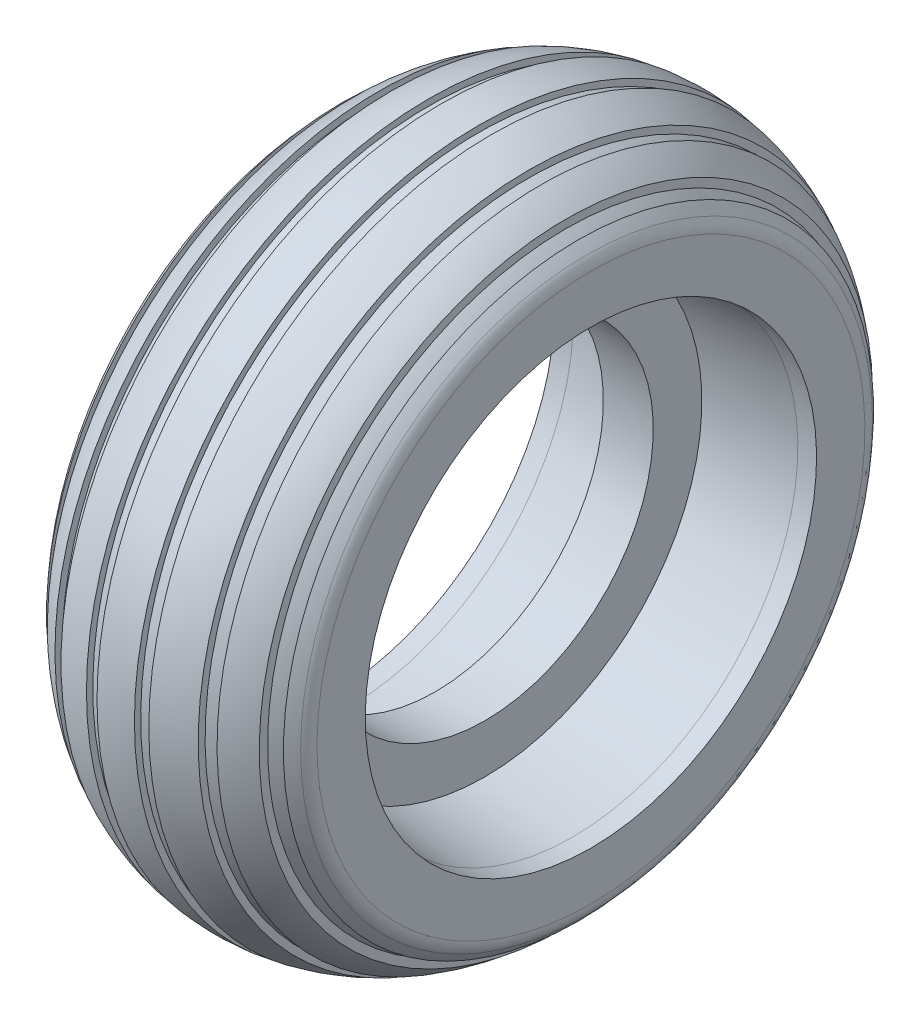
ISO-10303-21;
HEADER;
FILE_DESCRIPTION(('STEP AP214'),'2;1');
FILE_NAME('part.step','',(''),(''),'','','');
FILE_SCHEMA(('AUTOMOTIVE_DESIGN { 1 0 10303 214 1 1 1 1 }'));
ENDSEC;
DATA;
#1=APPLICATION_CONTEXT('core data for automotive mechanical design processes');
#2=APPLICATION_PROTOCOL_DEFINITION('international standard','automotive_design',2000,#1);
#3=PRODUCT_CONTEXT('',#1,'mechanical');
#4=PRODUCT('Part','Part','',(#3));
#5=PRODUCT_RELATED_PRODUCT_CATEGORY('part','',(#4));
#6=PRODUCT_DEFINITION_FORMATION('','',#4);
#7=PRODUCT_DEFINITION_CONTEXT('part definition',#1,'design');
#8=PRODUCT_DEFINITION('design','',#6,#7);
#9=PRODUCT_DEFINITION_SHAPE('','',#8);
#10=(LENGTH_UNIT() NAMED_UNIT(*) SI_UNIT(.MILLI.,.METRE.));
#11=(NAMED_UNIT(*) PLANE_ANGLE_UNIT() SI_UNIT($,.RADIAN.));
#12=(NAMED_UNIT(*) SI_UNIT($,.STERADIAN.) SOLID_ANGLE_UNIT());
#13=UNCERTAINTY_MEASURE_WITH_UNIT(LENGTH_MEASURE(1.E-05),#10,'distance_accuracy_value','');
#14=(GEOMETRIC_REPRESENTATION_CONTEXT(3) GLOBAL_UNCERTAINTY_ASSIGNED_CONTEXT((#13)) GLOBAL_UNIT_ASSIGNED_CONTEXT((#10,
#11,#12)) REPRESENTATION_CONTEXT('',''));
#15=CARTESIAN_POINT('',(0.,0.,0.));
#16=DIRECTION('',(0.,0.,1.));
#17=DIRECTION('',(1.,0.,0.));
#18=AXIS2_PLACEMENT_3D('',#15,#16,#17);
#19=CARTESIAN_POINT('',(-61.4889458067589,0.,0.));
#20=DIRECTION('',(-1.,0.,0.));
#21=DIRECTION('',(0.,-1.,0.));
#22=AXIS2_PLACEMENT_3D('',#19,#20,#21);
#23=CYLINDRICAL_SURFACE('',#22,18.1);
#24=CARTESIAN_POINT('',(-9.,0.,0.));
#25=DIRECTION('',(-1.,0.,0.));
#26=DIRECTION('',(0.,-1.,0.));
#27=AXIS2_PLACEMENT_3D('',#24,#25,#26);
#28=CIRCLE('',#27,18.1);
#29=CARTESIAN_POINT('',(-9.,-18.1,0.));
#30=VERTEX_POINT('',#29);
#31=EDGE_CURVE('E144',#30,#30,#28,.T.);
#32=ORIENTED_EDGE('',*,*,#31,.F.);
#33=EDGE_LOOP('',(#32));
#34=FACE_BOUND('',#33,.T.);
#35=CARTESIAN_POINT('',(-10.5,0.,0.));
#36=DIRECTION('',(-1.,0.,0.));
#37=DIRECTION('',(0.,-1.,0.));
#38=AXIS2_PLACEMENT_3D('',#35,#36,#37);
#39=CIRCLE('',#38,18.1);
#40=CARTESIAN_POINT('',(-10.5,-18.1,0.));
#41=VERTEX_POINT('',#40);
#42=EDGE_CURVE('E10',#41,#41,#39,.T.);
#43=ORIENTED_EDGE('',*,*,#42,.T.);
#44=EDGE_LOOP('',(#43));
#45=FACE_BOUND('',#44,.T.);
#46=ADVANCED_FACE('F32',(#34,#45),#23,.F.);
#47=CARTESIAN_POINT('',(-10.5,18.1,0.));
#48=DIRECTION('',(1.,0.,0.));
#49=DIRECTION('',(0.,1.,0.));
#50=AXIS2_PLACEMENT_3D('',#47,#48,#49);
#51=PLANE('',#50);
#52=ORIENTED_EDGE('',*,*,#42,.F.);
#53=EDGE_LOOP('',(#52));
#54=FACE_BOUND('',#53,.T.);
#55=CARTESIAN_POINT('',(-10.5,0.,0.));
#56=DIRECTION('',(-1.,0.,0.));
#57=DIRECTION('',(0.,-1.,0.));
#58=AXIS2_PLACEMENT_3D('',#55,#56,#57);
#59=CIRCLE('',#58,21.97650467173);
#60=CARTESIAN_POINT('',(-10.5,-21.97650467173,0.));
#61=VERTEX_POINT('',#60);
#62=EDGE_CURVE('E38',#61,#61,#59,.T.);
#63=ORIENTED_EDGE('',*,*,#62,.T.);
#64=EDGE_LOOP('',(#63));
#65=FACE_BOUND('',#64,.T.);
#66=ADVANCED_FACE('F151',(#54,#65),#51,.F.);
#67=CARTESIAN_POINT('',(-9.,0.,0.));
#68=DIRECTION('',(-1.,0.,0.));
#69=DIRECTION('',(0.,-1.,0.));
#70=AXIS2_PLACEMENT_3D('',#67,#68,#69);
#71=TOROIDAL_SURFACE('',#70,21.97650467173,1.5);
#72=ORIENTED_EDGE('',*,*,#62,.F.);
#73=EDGE_LOOP('',(#72));
#74=FACE_BOUND('',#73,.T.);
#75=CARTESIAN_POINT('',(-10.1537513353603,0.,0.));
#76=DIRECTION('',(-1.,0.,0.));
#77=DIRECTION('',(0.,-1.,0.));
#78=AXIS2_PLACEMENT_3D('',#75,#76,#77);
#79=CIRCLE('',#78,22.9350754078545);
#80=CARTESIAN_POINT('',(-10.1537513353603,-22.9350754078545,0.));
#81=VERTEX_POINT('',#80);
#82=EDGE_CURVE('E42',#81,#81,#79,.T.);
#83=ORIENTED_EDGE('',*,*,#82,.T.);
#84=EDGE_LOOP('',(#83));
#85=FACE_BOUND('',#84,.T.);
#86=ADVANCED_FACE('F155',(#74,#85),#71,.T.);
#87=CARTESIAN_POINT('',(0.,0.,0.));
#88=DIRECTION('',(-1.,0.,0.));
#89=DIRECTION('',(0.,-1.,0.));
#90=AXIS2_PLACEMENT_3D('',#87,#88,#89);
#91=TOROIDAL_SURFACE('',#90,14.4990384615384,13.2009615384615);
#92=ORIENTED_EDGE('',*,*,#82,.F.);
#93=EDGE_LOOP('',(#92));
#94=FACE_BOUND('',#93,.T.);
#95=CARTESIAN_POINT('',(-9.49999999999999,0.,0.));
#96=DIRECTION('',(-1.,0.,0.));
#97=DIRECTION('',(0.,-1.,0.));
#98=AXIS2_PLACEMENT_3D('',#95,#96,#97);
#99=CIRCLE('',#98,23.6650291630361);
#100=CARTESIAN_POINT('',(-9.49999999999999,-23.6650291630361,0.));
#101=VERTEX_POINT('',#100);
#102=EDGE_CURVE('E46',#101,#101,#99,.T.);
#103=ORIENTED_EDGE('',*,*,#102,.T.);
#104=EDGE_LOOP('',(#103));
#105=FACE_BOUND('',#104,.T.);
#106=ADVANCED_FACE('F160',(#94,#105),#91,.T.);
#107=CARTESIAN_POINT('',(-9.5,23.6650291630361,0.));
#108=DIRECTION('',(-1.,0.,0.));
#109=DIRECTION('',(0.,-1.,0.));
#110=AXIS2_PLACEMENT_3D('',#107,#108,#109);
#111=PLANE('',#110);
#112=ORIENTED_EDGE('',*,*,#102,.F.);
#113=EDGE_LOOP('',(#112));
#114=FACE_BOUND('',#113,.T.);
#115=CARTESIAN_POINT('',(-9.49999999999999,0.,0.));
#116=DIRECTION('',(-1.,0.,0.));
#117=DIRECTION('',(0.,-1.,0.));
#118=AXIS2_PLACEMENT_3D('',#115,#116,#117);
#119=CIRCLE('',#118,22.929010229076);
#120=CARTESIAN_POINT('',(-9.49999999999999,-22.9290102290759,0.));
#121=VERTEX_POINT('',#120);
#122=EDGE_CURVE('E51',#121,#121,#119,.T.);
#123=ORIENTED_EDGE('',*,*,#122,.T.);
#124=EDGE_LOOP('',(#123));
#125=FACE_BOUND('',#124,.T.);
#126=ADVANCED_FACE('F166',(#114,#125),#111,.F.);
#127=CARTESIAN_POINT('',(0.,0.,0.));
#128=DIRECTION('',(-1.,0.,0.));
#129=DIRECTION('',(0.,-1.,0.));
#130=AXIS2_PLACEMENT_3D('',#127,#128,#129);
#131=TOROIDAL_SURFACE('',#130,14.4990384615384,12.7009615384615);
#132=ORIENTED_EDGE('',*,*,#122,.F.);
#133=EDGE_LOOP('',(#132));
#134=FACE_BOUND('',#133,.T.);
#135=CARTESIAN_POINT('',(-8.49999999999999,0.,0.));
#136=DIRECTION('',(-1.,0.,0.));
#137=DIRECTION('',(0.,-1.,0.));
#138=AXIS2_PLACEMENT_3D('',#135,#136,#137);
#139=CIRCLE('',#138,23.9364334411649);
#140=CARTESIAN_POINT('',(-8.49999999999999,-23.9364334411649,0.));
#141=VERTEX_POINT('',#140);
#142=EDGE_CURVE('E54',#141,#141,#139,.T.);
#143=ORIENTED_EDGE('',*,*,#142,.T.);
#144=EDGE_LOOP('',(#143));
#145=FACE_BOUND('',#144,.T.);
#146=ADVANCED_FACE('F170',(#134,#145),#131,.T.);
#147=CARTESIAN_POINT('',(-8.5,24.5993050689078,0.));
#148=DIRECTION('',(1.,0.,0.));
#149=DIRECTION('',(0.,1.,0.));
#150=AXIS2_PLACEMENT_3D('',#147,#148,#149);
#151=PLANE('',#150);
#152=ORIENTED_EDGE('',*,*,#142,.F.);
#153=EDGE_LOOP('',(#152));
#154=FACE_BOUND('',#153,.T.);
#155=CARTESIAN_POINT('',(-8.49999999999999,0.,0.));
#156=DIRECTION('',(-1.,0.,0.));
#157=DIRECTION('',(0.,-1.,0.));
#158=AXIS2_PLACEMENT_3D('',#155,#156,#157);
#159=CIRCLE('',#158,24.5993050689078);
#160=CARTESIAN_POINT('',(-8.49999999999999,-24.5993050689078,0.));
#161=VERTEX_POINT('',#160);
#162=EDGE_CURVE('E57',#161,#161,#159,.T.);
#163=ORIENTED_EDGE('',*,*,#162,.T.);
#164=EDGE_LOOP('',(#163));
#165=FACE_BOUND('',#164,.T.);
#166=ADVANCED_FACE('F174',(#154,#165),#151,.F.);
#167=CARTESIAN_POINT('',(0.,0.,0.));
#168=DIRECTION('',(-1.,0.,0.));
#169=DIRECTION('',(0.,-1.,0.));
#170=AXIS2_PLACEMENT_3D('',#167,#168,#169);
#171=TOROIDAL_SURFACE('',#170,14.4990384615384,13.2009615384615);
#172=ORIENTED_EDGE('',*,*,#162,.F.);
#173=EDGE_LOOP('',(#172));
#174=FACE_BOUND('',#173,.T.);
#175=CARTESIAN_POINT('',(-6.5,0.,0.));
#176=DIRECTION('',(-1.,0.,0.));
#177=DIRECTION('',(0.,-1.,0.));
#178=AXIS2_PLACEMENT_3D('',#175,#176,#177);
#179=CIRCLE('',#178,25.988833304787);
#180=CARTESIAN_POINT('',(-6.49999999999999,-25.988833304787,0.));
#181=VERTEX_POINT('',#180);
#182=EDGE_CURVE('E60',#181,#181,#179,.T.);
#183=ORIENTED_EDGE('',*,*,#182,.T.);
#184=EDGE_LOOP('',(#183));
#185=FACE_BOUND('',#184,.T.);
#186=ADVANCED_FACE('F178',(#174,#185),#171,.T.);
#187=CARTESIAN_POINT('',(-6.5,25.988833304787,0.));
#188=DIRECTION('',(-1.,0.,0.));
#189=DIRECTION('',(0.,-1.,0.));
#190=AXIS2_PLACEMENT_3D('',#187,#188,#189);
#191=PLANE('',#190);
#192=ORIENTED_EDGE('',*,*,#182,.F.);
#193=EDGE_LOOP('',(#192));
#194=FACE_BOUND('',#193,.T.);
#195=CARTESIAN_POINT('',(-6.49999999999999,0.,0.));
#196=DIRECTION('',(-1.,0.,0.));
#197=DIRECTION('',(0.,-1.,0.));
#198=AXIS2_PLACEMENT_3D('',#195,#196,#197);
#199=CIRCLE('',#198,25.410703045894);
#200=CARTESIAN_POINT('',(-6.49999999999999,-25.410703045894,0.));
#201=VERTEX_POINT('',#200);
#202=EDGE_CURVE('E63',#201,#201,#199,.T.);
#203=ORIENTED_EDGE('',*,*,#202,.T.);
#204=EDGE_LOOP('',(#203));
#205=FACE_BOUND('',#204,.T.);
#206=ADVANCED_FACE('F182',(#194,#205),#191,.F.);
#207=CARTESIAN_POINT('',(0.,0.,0.));
#208=DIRECTION('',(-1.,0.,0.));
#209=DIRECTION('',(0.,-1.,0.));
#210=AXIS2_PLACEMENT_3D('',#207,#208,#209);
#211=TOROIDAL_SURFACE('',#210,14.4990384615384,12.7009615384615);
#212=ORIENTED_EDGE('',*,*,#202,.F.);
#213=EDGE_LOOP('',(#212));
#214=FACE_BOUND('',#213,.T.);
#215=CARTESIAN_POINT('',(-5.49999999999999,0.,0.));
#216=DIRECTION('',(-1.,0.,0.));
#217=DIRECTION('',(0.,-1.,0.));
#218=AXIS2_PLACEMENT_3D('',#215,#216,#217);
#219=CIRCLE('',#218,25.9473756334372);
#220=CARTESIAN_POINT('',(-5.49999999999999,-25.9473756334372,0.));
#221=VERTEX_POINT('',#220);
#222=EDGE_CURVE('E66',#221,#221,#219,.T.);
#223=ORIENTED_EDGE('',*,*,#222,.T.);
#224=EDGE_LOOP('',(#223));
#225=FACE_BOUND('',#224,.T.);
#226=ADVANCED_FACE('F186',(#214,#225),#211,.T.);
#227=CARTESIAN_POINT('',(-5.5,26.4996795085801,0.));
#228=DIRECTION('',(1.,0.,0.));
#229=DIRECTION('',(0.,1.,0.));
#230=AXIS2_PLACEMENT_3D('',#227,#228,#229);
#231=PLANE('',#230);
#232=ORIENTED_EDGE('',*,*,#222,.F.);
#233=EDGE_LOOP('',(#232));
#234=FACE_BOUND('',#233,.T.);
#235=CARTESIAN_POINT('',(-5.49999999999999,0.,0.));
#236=DIRECTION('',(-1.,0.,0.));
#237=DIRECTION('',(0.,-1.,0.));
#238=AXIS2_PLACEMENT_3D('',#235,#236,#237);
#239=CIRCLE('',#238,26.4996795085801);
#240=CARTESIAN_POINT('',(-5.49999999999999,-26.4996795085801,0.));
#241=VERTEX_POINT('',#240);
#242=EDGE_CURVE('E69',#241,#241,#239,.T.);
#243=ORIENTED_EDGE('',*,*,#242,.T.);
#244=EDGE_LOOP('',(#243));
#245=FACE_BOUND('',#244,.T.);
#246=ADVANCED_FACE('F190',(#234,#245),#231,.F.);
#247=CARTESIAN_POINT('',(0.,0.,0.));
#248=DIRECTION('',(-1.,0.,0.));
#249=DIRECTION('',(0.,-1.,0.));
#250=AXIS2_PLACEMENT_3D('',#247,#248,#249);
#251=TOROIDAL_SURFACE('',#250,14.4990384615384,13.2009615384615);
#252=ORIENTED_EDGE('',*,*,#242,.F.);
#253=EDGE_LOOP('',(#252));
#254=FACE_BOUND('',#253,.T.);
#255=CARTESIAN_POINT('',(-2.5,0.,0.));
#256=DIRECTION('',(-1.,0.,0.));
#257=DIRECTION('',(0.,-1.,0.));
#258=AXIS2_PLACEMENT_3D('',#255,#256,#257);
#259=CIRCLE('',#258,27.4611133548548);
#260=CARTESIAN_POINT('',(-2.49999999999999,-27.4611133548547,0.));
#261=VERTEX_POINT('',#260);
#262=EDGE_CURVE('E72',#261,#261,#259,.T.);
#263=ORIENTED_EDGE('',*,*,#262,.T.);
#264=EDGE_LOOP('',(#263));
#265=FACE_BOUND('',#264,.T.);
#266=ADVANCED_FACE('F194',(#254,#265),#251,.T.);
#267=CARTESIAN_POINT('',(-2.5,27.4611133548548,0.));
#268=DIRECTION('',(-1.,0.,0.));
#269=DIRECTION('',(0.,-1.,0.));
#270=AXIS2_PLACEMENT_3D('',#267,#268,#269);
#271=PLANE('',#270);
#272=ORIENTED_EDGE('',*,*,#262,.F.);
#273=EDGE_LOOP('',(#272));
#274=FACE_BOUND('',#273,.T.);
#275=CARTESIAN_POINT('',(-2.5,0.,0.));
#276=DIRECTION('',(-1.,0.,0.));
#277=DIRECTION('',(0.,-1.,0.));
#278=AXIS2_PLACEMENT_3D('',#275,#276,#277);
#279=CIRCLE('',#278,26.9515251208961);
#280=CARTESIAN_POINT('',(-2.49999999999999,-26.9515251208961,0.));
#281=VERTEX_POINT('',#280);
#282=EDGE_CURVE('E75',#281,#281,#279,.T.);
#283=ORIENTED_EDGE('',*,*,#282,.T.);
#284=EDGE_LOOP('',(#283));
#285=FACE_BOUND('',#284,.T.);
#286=ADVANCED_FACE('F198',(#274,#285),#271,.F.);
#287=CARTESIAN_POINT('',(0.,0.,0.));
#288=DIRECTION('',(-1.,0.,0.));
#289=DIRECTION('',(0.,-1.,0.));
#290=AXIS2_PLACEMENT_3D('',#287,#288,#289);
#291=TOROIDAL_SURFACE('',#290,14.4990384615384,12.7009615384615);
#292=ORIENTED_EDGE('',*,*,#282,.F.);
#293=EDGE_LOOP('',(#292));
#294=FACE_BOUND('',#293,.T.);
#295=CARTESIAN_POINT('',(-1.49999999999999,0.,0.));
#296=DIRECTION('',(-1.,0.,0.));
#297=DIRECTION('',(0.,-1.,0.));
#298=AXIS2_PLACEMENT_3D('',#295,#296,#297);
#299=CIRCLE('',#298,27.1111129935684);
#300=CARTESIAN_POINT('',(-1.49999999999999,-27.1111129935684,0.));
#301=VERTEX_POINT('',#300);
#302=EDGE_CURVE('E78',#301,#301,#299,.T.);
#303=ORIENTED_EDGE('',*,*,#302,.T.);
#304=EDGE_LOOP('',(#303));
#305=FACE_BOUND('',#304,.T.);
#306=ADVANCED_FACE('F202',(#294,#305),#291,.T.);
#307=CARTESIAN_POINT('',(-1.5,27.614502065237,0.));
#308=DIRECTION('',(1.,0.,0.));
#309=DIRECTION('',(0.,1.,0.));
#310=AXIS2_PLACEMENT_3D('',#307,#308,#309);
#311=PLANE('',#310);
#312=ORIENTED_EDGE('',*,*,#302,.F.);
#313=EDGE_LOOP('',(#312));
#314=FACE_BOUND('',#313,.T.);
#315=CARTESIAN_POINT('',(-1.49999999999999,0.,0.));
#316=DIRECTION('',(-1.,0.,0.));
#317=DIRECTION('',(0.,-1.,0.));
#318=AXIS2_PLACEMENT_3D('',#315,#316,#317);
#319=CIRCLE('',#318,27.614502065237);
#320=CARTESIAN_POINT('',(-1.49999999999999,-27.614502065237,0.));
#321=VERTEX_POINT('',#320);
#322=EDGE_CURVE('E81',#321,#321,#319,.T.);
#323=ORIENTED_EDGE('',*,*,#322,.T.);
#324=EDGE_LOOP('',(#323));
#325=FACE_BOUND('',#324,.T.);
#326=ADVANCED_FACE('F206',(#314,#325),#311,.F.);
#327=CARTESIAN_POINT('',(0.,0.,0.));
#328=DIRECTION('',(-1.,0.,0.));
#329=DIRECTION('',(0.,-1.,0.));
#330=AXIS2_PLACEMENT_3D('',#327,#328,#329);
#331=TOROIDAL_SURFACE('',#330,14.4990384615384,13.2009615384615);
#332=ORIENTED_EDGE('',*,*,#322,.F.);
#333=EDGE_LOOP('',(#332));
#334=FACE_BOUND('',#333,.T.);
#335=CARTESIAN_POINT('',(1.5,0.,0.));
#336=DIRECTION('',(-1.,0.,0.));
#337=DIRECTION('',(0.,-1.,0.));
#338=AXIS2_PLACEMENT_3D('',#335,#336,#337);
#339=CIRCLE('',#338,27.614502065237);
#340=CARTESIAN_POINT('',(1.50000000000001,-27.614502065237,0.));
#341=VERTEX_POINT('',#340);
#342=EDGE_CURVE('E84',#341,#341,#339,.T.);
#343=ORIENTED_EDGE('',*,*,#342,.T.);
#344=EDGE_LOOP('',(#343));
#345=FACE_BOUND('',#344,.T.);
#346=ADVANCED_FACE('F210',(#334,#345),#331,.T.);
#347=CARTESIAN_POINT('',(1.5,27.614502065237,0.));
#348=DIRECTION('',(-1.,0.,0.));
#349=DIRECTION('',(0.,-1.,0.));
#350=AXIS2_PLACEMENT_3D('',#347,#348,#349);
#351=PLANE('',#350);
#352=ORIENTED_EDGE('',*,*,#342,.F.);
#353=EDGE_LOOP('',(#352));
#354=FACE_BOUND('',#353,.T.);
#355=CARTESIAN_POINT('',(1.5,0.,0.));
#356=DIRECTION('',(-1.,0.,0.));
#357=DIRECTION('',(0.,-1.,0.));
#358=AXIS2_PLACEMENT_3D('',#355,#356,#357);
#359=CIRCLE('',#358,27.1111129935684);
#360=CARTESIAN_POINT('',(1.50000000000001,-27.1111129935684,0.));
#361=VERTEX_POINT('',#360);
#362=EDGE_CURVE('E87',#361,#361,#359,.T.);
#363=ORIENTED_EDGE('',*,*,#362,.T.);
#364=EDGE_LOOP('',(#363));
#365=FACE_BOUND('',#364,.T.);
#366=ADVANCED_FACE('F214',(#354,#365),#351,.F.);
#367=CARTESIAN_POINT('',(0.,0.,0.));
#368=DIRECTION('',(-1.,0.,0.));
#369=DIRECTION('',(0.,-1.,0.));
#370=AXIS2_PLACEMENT_3D('',#367,#368,#369);
#371=TOROIDAL_SURFACE('',#370,14.4990384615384,12.7009615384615);
#372=ORIENTED_EDGE('',*,*,#362,.F.);
#373=EDGE_LOOP('',(#372));
#374=FACE_BOUND('',#373,.T.);
#375=CARTESIAN_POINT('',(2.5,0.,0.));
#376=DIRECTION('',(-1.,0.,0.));
#377=DIRECTION('',(0.,-1.,0.));
#378=AXIS2_PLACEMENT_3D('',#375,#376,#377);
#379=CIRCLE('',#378,26.9515251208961);
#380=CARTESIAN_POINT('',(2.50000000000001,-26.951525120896,0.));
#381=VERTEX_POINT('',#380);
#382=EDGE_CURVE('E90',#381,#381,#379,.T.);
#383=ORIENTED_EDGE('',*,*,#382,.T.);
#384=EDGE_LOOP('',(#383));
#385=FACE_BOUND('',#384,.T.);
#386=ADVANCED_FACE('F218',(#374,#385),#371,.T.);
#387=CARTESIAN_POINT('',(2.5,27.4611133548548,0.));
#388=DIRECTION('',(1.,0.,0.));
#389=DIRECTION('',(0.,1.,0.));
#390=AXIS2_PLACEMENT_3D('',#387,#388,#389);
#391=PLANE('',#390);
#392=ORIENTED_EDGE('',*,*,#382,.F.);
#393=EDGE_LOOP('',(#392));
#394=FACE_BOUND('',#393,.T.);
#395=CARTESIAN_POINT('',(2.5,0.,0.));
#396=DIRECTION('',(-1.,0.,0.));
#397=DIRECTION('',(0.,-1.,0.));
#398=AXIS2_PLACEMENT_3D('',#395,#396,#397);
#399=CIRCLE('',#398,27.4611133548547);
#400=CARTESIAN_POINT('',(2.50000000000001,-27.4611133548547,0.));
#401=VERTEX_POINT('',#400);
#402=EDGE_CURVE('E93',#401,#401,#399,.T.);
#403=ORIENTED_EDGE('',*,*,#402,.T.);
#404=EDGE_LOOP('',(#403));
#405=FACE_BOUND('',#404,.T.);
#406=ADVANCED_FACE('F222',(#394,#405),#391,.F.);
#407=CARTESIAN_POINT('',(0.,0.,0.));
#408=DIRECTION('',(-1.,0.,0.));
#409=DIRECTION('',(0.,-1.,0.));
#410=AXIS2_PLACEMENT_3D('',#407,#408,#409);
#411=TOROIDAL_SURFACE('',#410,14.4990384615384,13.2009615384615);
#412=ORIENTED_EDGE('',*,*,#402,.F.);
#413=EDGE_LOOP('',(#412));
#414=FACE_BOUND('',#413,.T.);
#415=CARTESIAN_POINT('',(5.49999999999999,0.,0.));
#416=DIRECTION('',(-1.,0.,0.));
#417=DIRECTION('',(0.,-1.,0.));
#418=AXIS2_PLACEMENT_3D('',#415,#416,#417);
#419=CIRCLE('',#418,26.4996795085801);
#420=CARTESIAN_POINT('',(5.5,-26.4996795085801,0.));
#421=VERTEX_POINT('',#420);
#422=EDGE_CURVE('E96',#421,#421,#419,.T.);
#423=ORIENTED_EDGE('',*,*,#422,.T.);
#424=EDGE_LOOP('',(#423));
#425=FACE_BOUND('',#424,.T.);
#426=ADVANCED_FACE('F226',(#414,#425),#411,.T.);
#427=CARTESIAN_POINT('',(5.5,26.4996795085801,0.));
#428=DIRECTION('',(-1.,0.,0.));
#429=DIRECTION('',(0.,-1.,0.));
#430=AXIS2_PLACEMENT_3D('',#427,#428,#429);
#431=PLANE('',#430);
#432=ORIENTED_EDGE('',*,*,#422,.F.);
#433=EDGE_LOOP('',(#432));
#434=FACE_BOUND('',#433,.T.);
#435=CARTESIAN_POINT('',(5.50000000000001,0.,0.));
#436=DIRECTION('',(-1.,0.,0.));
#437=DIRECTION('',(0.,-1.,0.));
#438=AXIS2_PLACEMENT_3D('',#435,#436,#437);
#439=CIRCLE('',#438,25.9473756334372);
#440=CARTESIAN_POINT('',(5.50000000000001,-25.9473756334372,0.));
#441=VERTEX_POINT('',#440);
#442=EDGE_CURVE('E99',#441,#441,#439,.T.);
#443=ORIENTED_EDGE('',*,*,#442,.T.);
#444=EDGE_LOOP('',(#443));
#445=FACE_BOUND('',#444,.T.);
#446=ADVANCED_FACE('F230',(#434,#445),#431,.F.);
#447=CARTESIAN_POINT('',(0.,0.,0.));
#448=DIRECTION('',(-1.,0.,0.));
#449=DIRECTION('',(0.,-1.,0.));
#450=AXIS2_PLACEMENT_3D('',#447,#448,#449);
#451=TOROIDAL_SURFACE('',#450,14.4990384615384,12.7009615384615);
#452=ORIENTED_EDGE('',*,*,#442,.F.);
#453=EDGE_LOOP('',(#452));
#454=FACE_BOUND('',#453,.T.);
#455=CARTESIAN_POINT('',(6.50000000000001,0.,0.));
#456=DIRECTION('',(-1.,0.,0.));
#457=DIRECTION('',(0.,-1.,0.));
#458=AXIS2_PLACEMENT_3D('',#455,#456,#457);
#459=CIRCLE('',#458,25.410703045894);
#460=CARTESIAN_POINT('',(6.50000000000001,-25.410703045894,0.));
#461=VERTEX_POINT('',#460);
#462=EDGE_CURVE('E102',#461,#461,#459,.T.);
#463=ORIENTED_EDGE('',*,*,#462,.T.);
#464=EDGE_LOOP('',(#463));
#465=FACE_BOUND('',#464,.T.);
#466=ADVANCED_FACE('F234',(#454,#465),#451,.T.);
#467=CARTESIAN_POINT('',(6.5,25.988833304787,0.));
#468=DIRECTION('',(1.,0.,0.));
#469=DIRECTION('',(0.,1.,0.));
#470=AXIS2_PLACEMENT_3D('',#467,#468,#469);
#471=PLANE('',#470);
#472=ORIENTED_EDGE('',*,*,#462,.F.);
#473=EDGE_LOOP('',(#472));
#474=FACE_BOUND('',#473,.T.);
#475=CARTESIAN_POINT('',(6.50000000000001,0.,0.));
#476=DIRECTION('',(-1.,0.,0.));
#477=DIRECTION('',(0.,-1.,0.));
#478=AXIS2_PLACEMENT_3D('',#475,#476,#477);
#479=CIRCLE('',#478,25.988833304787);
#480=CARTESIAN_POINT('',(6.50000000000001,-25.988833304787,0.));
#481=VERTEX_POINT('',#480);
#482=EDGE_CURVE('E105',#481,#481,#479,.T.);
#483=ORIENTED_EDGE('',*,*,#482,.T.);
#484=EDGE_LOOP('',(#483));
#485=FACE_BOUND('',#484,.T.);
#486=ADVANCED_FACE('F238',(#474,#485),#471,.F.);
#487=CARTESIAN_POINT('',(0.,0.,0.));
#488=DIRECTION('',(-1.,0.,0.));
#489=DIRECTION('',(0.,-1.,0.));
#490=AXIS2_PLACEMENT_3D('',#487,#488,#489);
#491=TOROIDAL_SURFACE('',#490,14.4990384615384,13.2009615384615);
#492=ORIENTED_EDGE('',*,*,#482,.F.);
#493=EDGE_LOOP('',(#492));
#494=FACE_BOUND('',#493,.T.);
#495=CARTESIAN_POINT('',(8.49999999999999,0.,0.));
#496=DIRECTION('',(-1.,0.,0.));
#497=DIRECTION('',(0.,-1.,0.));
#498=AXIS2_PLACEMENT_3D('',#495,#496,#497);
#499=CIRCLE('',#498,24.5993050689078);
#500=CARTESIAN_POINT('',(8.5,-24.5993050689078,0.));
#501=VERTEX_POINT('',#500);
#502=EDGE_CURVE('E108',#501,#501,#499,.T.);
#503=ORIENTED_EDGE('',*,*,#502,.T.);
#504=EDGE_LOOP('',(#503));
#505=FACE_BOUND('',#504,.T.);
#506=ADVANCED_FACE('F242',(#494,#505),#491,.T.);
#507=CARTESIAN_POINT('',(8.5,24.5993050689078,0.));
#508=DIRECTION('',(-1.,0.,0.));
#509=DIRECTION('',(0.,-1.,0.));
#510=AXIS2_PLACEMENT_3D('',#507,#508,#509);
#511=PLANE('',#510);
#512=ORIENTED_EDGE('',*,*,#502,.F.);
#513=EDGE_LOOP('',(#512));
#514=FACE_BOUND('',#513,.T.);
#515=CARTESIAN_POINT('',(8.49999999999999,0.,0.));
#516=DIRECTION('',(-1.,0.,0.));
#517=DIRECTION('',(0.,-1.,0.));
#518=AXIS2_PLACEMENT_3D('',#515,#516,#517);
#519=CIRCLE('',#518,23.9364334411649);
#520=CARTESIAN_POINT('',(8.5,-23.9364334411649,0.));
#521=VERTEX_POINT('',#520);
#522=EDGE_CURVE('E111',#521,#521,#519,.T.);
#523=ORIENTED_EDGE('',*,*,#522,.T.);
#524=EDGE_LOOP('',(#523));
#525=FACE_BOUND('',#524,.T.);
#526=ADVANCED_FACE('F246',(#514,#525),#511,.F.);
#527=CARTESIAN_POINT('',(0.,0.,0.));
#528=DIRECTION('',(-1.,0.,0.));
#529=DIRECTION('',(0.,-1.,0.));
#530=AXIS2_PLACEMENT_3D('',#527,#528,#529);
#531=TOROIDAL_SURFACE('',#530,14.4990384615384,12.7009615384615);
#532=ORIENTED_EDGE('',*,*,#522,.F.);
#533=EDGE_LOOP('',(#532));
#534=FACE_BOUND('',#533,.T.);
#535=CARTESIAN_POINT('',(9.50000000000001,0.,0.));
#536=DIRECTION('',(-1.,0.,0.));
#537=DIRECTION('',(0.,-1.,0.));
#538=AXIS2_PLACEMENT_3D('',#535,#536,#537);
#539=CIRCLE('',#538,22.9290102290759);
#540=CARTESIAN_POINT('',(9.50000000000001,-22.9290102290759,0.));
#541=VERTEX_POINT('',#540);
#542=EDGE_CURVE('E114',#541,#541,#539,.T.);
#543=ORIENTED_EDGE('',*,*,#542,.T.);
#544=EDGE_LOOP('',(#543));
#545=FACE_BOUND('',#544,.T.);
#546=ADVANCED_FACE('F250',(#534,#545),#531,.T.);
#547=CARTESIAN_POINT('',(9.5,23.6650291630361,0.));
#548=DIRECTION('',(1.,0.,0.));
#549=DIRECTION('',(0.,1.,0.));
#550=AXIS2_PLACEMENT_3D('',#547,#548,#549);
#551=PLANE('',#550);
#552=ORIENTED_EDGE('',*,*,#542,.F.);
#553=EDGE_LOOP('',(#552));
#554=FACE_BOUND('',#553,.T.);
#555=CARTESIAN_POINT('',(9.50000000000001,0.,0.));
#556=DIRECTION('',(-1.,0.,0.));
#557=DIRECTION('',(0.,-1.,0.));
#558=AXIS2_PLACEMENT_3D('',#555,#556,#557);
#559=CIRCLE('',#558,23.6650291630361);
#560=CARTESIAN_POINT('',(9.50000000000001,-23.665029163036,0.));
#561=VERTEX_POINT('',#560);
#562=EDGE_CURVE('E117',#561,#561,#559,.T.);
#563=ORIENTED_EDGE('',*,*,#562,.T.);
#564=EDGE_LOOP('',(#563));
#565=FACE_BOUND('',#564,.T.);
#566=ADVANCED_FACE('F254',(#554,#565),#551,.F.);
#567=CARTESIAN_POINT('',(0.,0.,0.));
#568=DIRECTION('',(-1.,0.,0.));
#569=DIRECTION('',(0.,-1.,0.));
#570=AXIS2_PLACEMENT_3D('',#567,#568,#569);
#571=TOROIDAL_SURFACE('',#570,14.4990384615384,13.2009615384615);
#572=ORIENTED_EDGE('',*,*,#562,.F.);
#573=EDGE_LOOP('',(#572));
#574=FACE_BOUND('',#573,.T.);
#575=CARTESIAN_POINT('',(10.1537513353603,0.,0.));
#576=DIRECTION('',(-1.,0.,0.));
#577=DIRECTION('',(0.,-1.,0.));
#578=AXIS2_PLACEMENT_3D('',#575,#576,#577);
#579=CIRCLE('',#578,22.9350754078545);
#580=CARTESIAN_POINT('',(10.1537513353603,-22.9350754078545,0.));
#581=VERTEX_POINT('',#580);
#582=EDGE_CURVE('E120',#581,#581,#579,.T.);
#583=ORIENTED_EDGE('',*,*,#582,.T.);
#584=EDGE_LOOP('',(#583));
#585=FACE_BOUND('',#584,.T.);
#586=ADVANCED_FACE('F258',(#574,#585),#571,.T.);
#587=CARTESIAN_POINT('',(9.,0.,0.));
#588=DIRECTION('',(-1.,0.,0.));
#589=DIRECTION('',(0.,-1.,0.));
#590=AXIS2_PLACEMENT_3D('',#587,#588,#589);
#591=TOROIDAL_SURFACE('',#590,21.97650467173,1.5);
#592=ORIENTED_EDGE('',*,*,#582,.F.);
#593=EDGE_LOOP('',(#592));
#594=FACE_BOUND('',#593,.T.);
#595=CARTESIAN_POINT('',(10.5,0.,0.));
#596=DIRECTION('',(-1.,0.,0.));
#597=DIRECTION('',(0.,-1.,0.));
#598=AXIS2_PLACEMENT_3D('',#595,#596,#597);
#599=CIRCLE('',#598,21.97650467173);
#600=CARTESIAN_POINT('',(10.5,-21.97650467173,0.));
#601=VERTEX_POINT('',#600);
#602=EDGE_CURVE('E123',#601,#601,#599,.T.);
#603=ORIENTED_EDGE('',*,*,#602,.T.);
#604=EDGE_LOOP('',(#603));
#605=FACE_BOUND('',#604,.T.);
#606=ADVANCED_FACE('F262',(#594,#605),#591,.T.);
#607=CARTESIAN_POINT('',(10.5,18.1,0.));
#608=DIRECTION('',(-1.,0.,0.));
#609=DIRECTION('',(0.,-1.,0.));
#610=AXIS2_PLACEMENT_3D('',#607,#608,#609);
#611=PLANE('',#610);
#612=ORIENTED_EDGE('',*,*,#602,.F.);
#613=EDGE_LOOP('',(#612));
#614=FACE_BOUND('',#613,.T.);
#615=CARTESIAN_POINT('',(10.5,0.,0.));
#616=DIRECTION('',(-1.,0.,0.));
#617=DIRECTION('',(0.,-1.,0.));
#618=AXIS2_PLACEMENT_3D('',#615,#616,#617);
#619=CIRCLE('',#618,18.1);
#620=CARTESIAN_POINT('',(10.5,-18.1,0.));
#621=VERTEX_POINT('',#620);
#622=EDGE_CURVE('E126',#621,#621,#619,.T.);
#623=ORIENTED_EDGE('',*,*,#622,.T.);
#624=EDGE_LOOP('',(#623));
#625=FACE_BOUND('',#624,.T.);
#626=ADVANCED_FACE('F266',(#614,#625),#611,.F.);
#627=CARTESIAN_POINT('',(-61.4889458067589,0.,0.));
#628=DIRECTION('',(-1.,0.,0.));
#629=DIRECTION('',(0.,-1.,0.));
#630=AXIS2_PLACEMENT_3D('',#627,#628,#629);
#631=CYLINDRICAL_SURFACE('',#630,18.1);
#632=ORIENTED_EDGE('',*,*,#622,.F.);
#633=EDGE_LOOP('',(#632));
#634=FACE_BOUND('',#633,.T.);
#635=CARTESIAN_POINT('',(8.99999999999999,0.,0.));
#636=DIRECTION('',(-1.,0.,0.));
#637=DIRECTION('',(0.,-1.,0.));
#638=AXIS2_PLACEMENT_3D('',#635,#636,#637);
#639=CIRCLE('',#638,18.1);
#640=CARTESIAN_POINT('',(9.,-18.1,0.));
#641=VERTEX_POINT('',#640);
#642=EDGE_CURVE('E129',#641,#641,#639,.T.);
#643=ORIENTED_EDGE('',*,*,#642,.T.);
#644=EDGE_LOOP('',(#643));
#645=FACE_BOUND('',#644,.T.);
#646=ADVANCED_FACE('F270',(#634,#645),#631,.F.);
#647=CARTESIAN_POINT('',(2.,0.,0.));
#648=DIRECTION('',(1.,0.,0.));
#649=DIRECTION('',(0.,1.,0.));
#650=AXIS2_PLACEMENT_3D('',#647,#648,#649);
#651=CONICAL_SURFACE('',#650,17.4,0.099668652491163);
#652=ORIENTED_EDGE('',*,*,#642,.F.);
#653=EDGE_LOOP('',(#652));
#654=FACE_BOUND('',#653,.T.);
#655=CARTESIAN_POINT('',(2.,0.,0.));
#656=DIRECTION('',(-1.,0.,0.));
#657=DIRECTION('',(0.,-1.,0.));
#658=AXIS2_PLACEMENT_3D('',#655,#656,#657);
#659=CIRCLE('',#658,17.4);
#660=CARTESIAN_POINT('',(2.,-17.4,0.));
#661=VERTEX_POINT('',#660);
#662=EDGE_CURVE('E132',#661,#661,#659,.T.);
#663=ORIENTED_EDGE('',*,*,#662,.T.);
#664=EDGE_LOOP('',(#663));
#665=FACE_BOUND('',#664,.T.);
#666=ADVANCED_FACE('F274',(#654,#665),#651,.F.);
#667=CARTESIAN_POINT('',(2.,17.4,0.));
#668=DIRECTION('',(-1.,0.,0.));
#669=DIRECTION('',(0.,-1.,0.));
#670=AXIS2_PLACEMENT_3D('',#667,#668,#669);
#671=PLANE('',#670);
#672=ORIENTED_EDGE('',*,*,#662,.F.);
#673=EDGE_LOOP('',(#672));
#674=FACE_BOUND('',#673,.T.);
#675=CARTESIAN_POINT('',(2.,0.,0.));
#676=DIRECTION('',(-1.,0.,0.));
#677=DIRECTION('',(0.,-1.,0.));
#678=AXIS2_PLACEMENT_3D('',#675,#676,#677);
#679=CIRCLE('',#678,13.5);
#680=CARTESIAN_POINT('',(2.,-13.5,0.));
#681=VERTEX_POINT('',#680);
#682=EDGE_CURVE('E135',#681,#681,#679,.T.);
#683=ORIENTED_EDGE('',*,*,#682,.T.);
#684=EDGE_LOOP('',(#683));
#685=FACE_BOUND('',#684,.T.);
#686=ADVANCED_FACE('F278',(#674,#685),#671,.F.);
#687=CARTESIAN_POINT('',(-61.4889458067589,0.,0.));
#688=DIRECTION('',(-1.,0.,0.));
#689=DIRECTION('',(0.,-1.,0.));
#690=AXIS2_PLACEMENT_3D('',#687,#688,#689);
#691=CYLINDRICAL_SURFACE('',#690,13.5);
#692=ORIENTED_EDGE('',*,*,#682,.F.);
#693=EDGE_LOOP('',(#692));
#694=FACE_BOUND('',#693,.T.);
#695=CARTESIAN_POINT('',(-2.,0.,0.));
#696=DIRECTION('',(-1.,0.,0.));
#697=DIRECTION('',(0.,-1.,0.));
#698=AXIS2_PLACEMENT_3D('',#695,#696,#697);
#699=CIRCLE('',#698,13.5);
#700=CARTESIAN_POINT('',(-2.,-13.5,0.));
#701=VERTEX_POINT('',#700);
#702=EDGE_CURVE('E138',#701,#701,#699,.T.);
#703=ORIENTED_EDGE('',*,*,#702,.T.);
#704=EDGE_LOOP('',(#703));
#705=FACE_BOUND('',#704,.T.);
#706=ADVANCED_FACE('F282',(#694,#705),#691,.F.);
#707=CARTESIAN_POINT('',(-2.,13.5,0.));
#708=DIRECTION('',(1.,0.,0.));
#709=DIRECTION('',(0.,1.,0.));
#710=AXIS2_PLACEMENT_3D('',#707,#708,#709);
#711=PLANE('',#710);
#712=ORIENTED_EDGE('',*,*,#702,.F.);
#713=EDGE_LOOP('',(#712));
#714=FACE_BOUND('',#713,.T.);
#715=CARTESIAN_POINT('',(-2.,0.,0.));
#716=DIRECTION('',(-1.,0.,0.));
#717=DIRECTION('',(0.,-1.,0.));
#718=AXIS2_PLACEMENT_3D('',#715,#716,#717);
#719=CIRCLE('',#718,17.4);
#720=CARTESIAN_POINT('',(-2.,-17.4,0.));
#721=VERTEX_POINT('',#720);
#722=EDGE_CURVE('E141',#721,#721,#719,.T.);
#723=ORIENTED_EDGE('',*,*,#722,.T.);
#724=EDGE_LOOP('',(#723));
#725=FACE_BOUND('',#724,.T.);
#726=ADVANCED_FACE('F286',(#714,#725),#711,.F.);
#727=CARTESIAN_POINT('',(-9.,0.,0.));
#728=DIRECTION('',(-1.,0.,0.));
#729=DIRECTION('',(0.,-1.,0.));
#730=AXIS2_PLACEMENT_3D('',#727,#728,#729);
#731=CONICAL_SURFACE('',#730,18.1,0.0996686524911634);
#732=ORIENTED_EDGE('',*,*,#722,.F.);
#733=EDGE_LOOP('',(#732));
#734=FACE_BOUND('',#733,.T.);
#735=ORIENTED_EDGE('',*,*,#31,.T.);
#736=EDGE_LOOP('',(#735));
#737=FACE_BOUND('',#736,.T.);
#738=ADVANCED_FACE('F148',(#734,#737),#731,.F.);
#739=CLOSED_SHELL('',(#46,#66,#86,#106,#126,#146,#166,#186,#206,#226,#246,#266,#286,#306,#326,
#346,#366,#386,#406,#426,#446,#466,#486,#506,#526,#546,#566,#586,#606,#626,#646,#666,#686,#706,
#726,#738));
#740=MANIFOLD_SOLID_BREP('B2',#739);
#741=ADVANCED_BREP_SHAPE_REPRESENTATION('',(#18,#740),#14);
#742=SHAPE_DEFINITION_REPRESENTATION(#9,#741);
ENDSEC;
END-ISO-10303-21;
